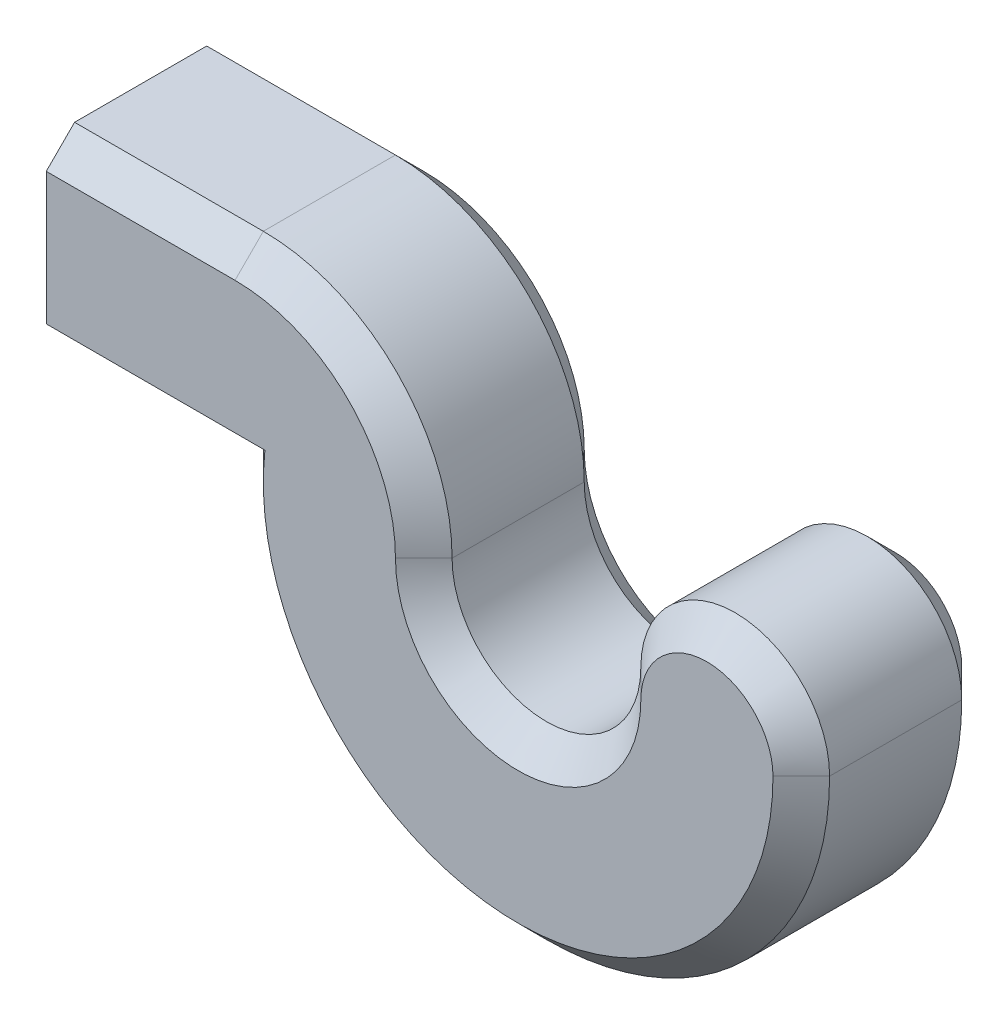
from build123d import *

# Parameters (mm, degrees)
EXTRUDE_2_DEPTH = 2
CHAMFER_1_SIZE  = 0.6


with BuildPart() as part:
    # Sketch 1 → Extrude 2 (new, symmetric)
    with BuildSketch(Plane.XY):
        with BuildLine():
            Line((0, 0), (0, 4))
            Line((0, 4), (4, 4))
            ThreePointArc((4, 4), (6.828427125, 2.828427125), (8, 0))
            ThreePointArc((8, 0), (10, -2), (12, 0))
            ThreePointArc((12, 0), (14, 2), (16, 0))
            ThreePointArc((16, 0), (10, -6), (4, 0))
            Line((4, 0), (0, 0))
        make_face()
    extrude(amount=EXTRUDE_2_DEPTH, both=True)

    # Chamfer 1
    chamfer_1_edges = [part.edges().sort_by_distance(p)[0] for p in [
        (2, 0, -2),
        (14, 2, 2),
        (10, -2, 2),
        (6.828427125, 2.828427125, 2),
        (2, 4, 2),
        (2, 0, 2),
        (2, 4, -2),
        (6.828427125, 2.828427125, -2),
        (10, -2, -2),
        (10, -6, 2),
        (14, 2, -2),
        (10, -6, -2),
    ]]
    chamfer(chamfer_1_edges, length=CHAMFER_1_SIZE)


solid = part.part
